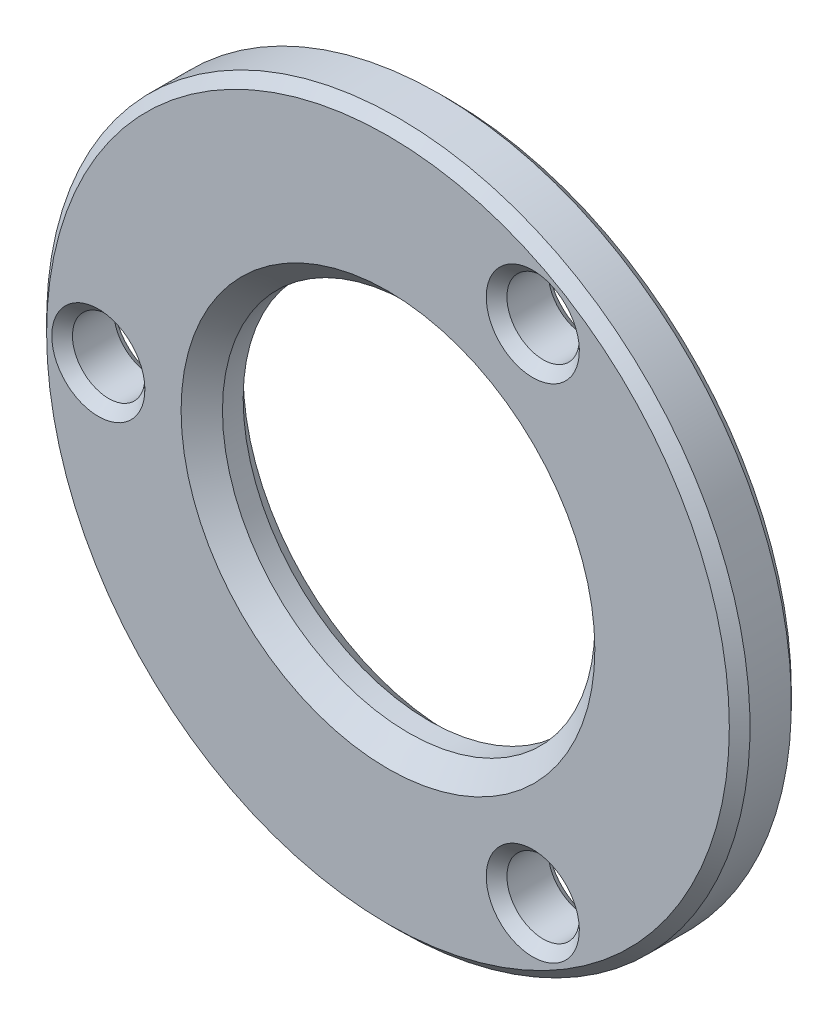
ISO-10303-21;
HEADER;
FILE_DESCRIPTION(('STEP AP214'),'2;1');
FILE_NAME('part.step','',(''),(''),'','','');
FILE_SCHEMA(('AUTOMOTIVE_DESIGN { 1 0 10303 214 1 1 1 1 }'));
ENDSEC;
DATA;
#1=APPLICATION_CONTEXT('core data for automotive mechanical design processes');
#2=APPLICATION_PROTOCOL_DEFINITION('international standard','automotive_design',2000,#1);
#3=PRODUCT_CONTEXT('',#1,'mechanical');
#4=PRODUCT('Part','Part','',(#3));
#5=PRODUCT_RELATED_PRODUCT_CATEGORY('part','',(#4));
#6=PRODUCT_DEFINITION_FORMATION('','',#4);
#7=PRODUCT_DEFINITION_CONTEXT('part definition',#1,'design');
#8=PRODUCT_DEFINITION('design','',#6,#7);
#9=PRODUCT_DEFINITION_SHAPE('','',#8);
#10=(LENGTH_UNIT() NAMED_UNIT(*) SI_UNIT(.MILLI.,.METRE.));
#11=(NAMED_UNIT(*) PLANE_ANGLE_UNIT() SI_UNIT($,.RADIAN.));
#12=(NAMED_UNIT(*) SI_UNIT($,.STERADIAN.) SOLID_ANGLE_UNIT());
#13=UNCERTAINTY_MEASURE_WITH_UNIT(LENGTH_MEASURE(1.E-05),#10,'distance_accuracy_value','');
#14=(GEOMETRIC_REPRESENTATION_CONTEXT(3) GLOBAL_UNCERTAINTY_ASSIGNED_CONTEXT((#13)) GLOBAL_UNIT_ASSIGNED_CONTEXT((#10,
#11,#12)) REPRESENTATION_CONTEXT('',''));
#15=CARTESIAN_POINT('',(0.,0.,0.));
#16=DIRECTION('',(0.,0.,1.));
#17=DIRECTION('',(1.,0.,0.));
#18=AXIS2_PLACEMENT_3D('',#15,#16,#17);
#19=CARTESIAN_POINT('',(0.,0.,3.));
#20=DIRECTION('',(0.,0.,1.));
#21=DIRECTION('',(0.,-1.,0.));
#22=AXIS2_PLACEMENT_3D('',#19,#20,#21);
#23=PLANE('',#22);
#24=CARTESIAN_POINT('',(0.,0.,3.));
#25=DIRECTION('',(0.,0.,1.));
#26=DIRECTION('',(0.,-1.,0.));
#27=AXIS2_PLACEMENT_3D('',#24,#25,#26);
#28=CIRCLE('',#27,10.);
#29=CARTESIAN_POINT('',(0.,-10.,3.));
#30=VERTEX_POINT('',#29);
#31=EDGE_CURVE('E8',#30,#30,#28,.F.);
#32=ORIENTED_EDGE('',*,*,#31,.T.);
#33=EDGE_LOOP('',(#32));
#34=FACE_BOUND('',#33,.T.);
#35=CARTESIAN_POINT('',(0.,0.,3.));
#36=DIRECTION('',(0.,0.,1.));
#37=DIRECTION('',(0.,-1.,0.));
#38=AXIS2_PLACEMENT_3D('',#35,#36,#37);
#39=CIRCLE('',#38,16.5);
#40=CARTESIAN_POINT('',(0.,-16.5,3.));
#41=VERTEX_POINT('',#40);
#42=EDGE_CURVE('E32',#41,#41,#39,.T.);
#43=ORIENTED_EDGE('',*,*,#42,.T.);
#44=EDGE_LOOP('',(#43));
#45=FACE_BOUND('',#44,.T.);
#46=CARTESIAN_POINT('',(-14.,0.,3.));
#47=DIRECTION('',(0.,0.,1.));
#48=DIRECTION('',(0.,-1.,0.));
#49=AXIS2_PLACEMENT_3D('',#46,#47,#48);
#50=CIRCLE('',#49,2.25);
#51=CARTESIAN_POINT('',(-14.,-2.25,3.));
#52=VERTEX_POINT('',#51);
#53=EDGE_CURVE('E74',#52,#52,#50,.T.);
#54=ORIENTED_EDGE('',*,*,#53,.F.);
#55=EDGE_LOOP('',(#54));
#56=FACE_BOUND('',#55,.T.);
#57=CARTESIAN_POINT('',(7.,12.1243556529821,3.));
#58=DIRECTION('',(0.,0.,1.));
#59=DIRECTION('',(0.,-1.,0.));
#60=AXIS2_PLACEMENT_3D('',#57,#58,#59);
#61=CIRCLE('',#60,2.25);
#62=CARTESIAN_POINT('',(7.,9.8743556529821,3.));
#63=VERTEX_POINT('',#62);
#64=EDGE_CURVE('E62',#63,#63,#61,.T.);
#65=ORIENTED_EDGE('',*,*,#64,.F.);
#66=EDGE_LOOP('',(#65));
#67=FACE_BOUND('',#66,.T.);
#68=CARTESIAN_POINT('',(6.99999999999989,-12.1243556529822,3.));
#69=DIRECTION('',(0.,0.,1.));
#70=DIRECTION('',(0.,-1.,0.));
#71=AXIS2_PLACEMENT_3D('',#68,#69,#70);
#72=CIRCLE('',#71,2.25);
#73=CARTESIAN_POINT('',(6.99999999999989,-14.3743556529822,3.));
#74=VERTEX_POINT('',#73);
#75=EDGE_CURVE('E50',#74,#74,#72,.T.);
#76=ORIENTED_EDGE('',*,*,#75,.F.);
#77=EDGE_LOOP('',(#76));
#78=FACE_BOUND('',#77,.T.);
#79=ADVANCED_FACE('F12',(#34,#45,#56,#67,#78),#23,.T.);
#80=CARTESIAN_POINT('',(0.,0.,0.));
#81=DIRECTION('',(0.,0.,1.));
#82=DIRECTION('',(0.,-1.,0.));
#83=AXIS2_PLACEMENT_3D('',#80,#81,#82);
#84=PLANE('',#83);
#85=CARTESIAN_POINT('',(0.,0.,0.));
#86=DIRECTION('',(0.,0.,1.));
#87=DIRECTION('',(0.,-1.,0.));
#88=AXIS2_PLACEMENT_3D('',#85,#86,#87);
#89=CIRCLE('',#88,10.);
#90=CARTESIAN_POINT('',(0.,-10.,0.));
#91=VERTEX_POINT('',#90);
#92=EDGE_CURVE('E27',#91,#91,#89,.T.);
#93=ORIENTED_EDGE('',*,*,#92,.T.);
#94=EDGE_LOOP('',(#93));
#95=FACE_BOUND('',#94,.T.);
#96=CARTESIAN_POINT('',(0.,0.,0.));
#97=DIRECTION('',(0.,0.,1.));
#98=DIRECTION('',(0.,-1.,0.));
#99=AXIS2_PLACEMENT_3D('',#96,#97,#98);
#100=CIRCLE('',#99,16.5);
#101=CARTESIAN_POINT('',(0.,-16.5,0.));
#102=VERTEX_POINT('',#101);
#103=EDGE_CURVE('E35',#102,#102,#100,.F.);
#104=ORIENTED_EDGE('',*,*,#103,.T.);
#105=EDGE_LOOP('',(#104));
#106=FACE_BOUND('',#105,.T.);
#107=CARTESIAN_POINT('',(-14.,0.,0.));
#108=DIRECTION('',(0.,0.,1.));
#109=DIRECTION('',(0.,-1.,0.));
#110=AXIS2_PLACEMENT_3D('',#107,#108,#109);
#111=CIRCLE('',#110,2.25);
#112=CARTESIAN_POINT('',(-14.,-2.25,0.));
#113=VERTEX_POINT('',#112);
#114=EDGE_CURVE('E77',#113,#113,#111,.T.);
#115=ORIENTED_EDGE('',*,*,#114,.T.);
#116=EDGE_LOOP('',(#115));
#117=FACE_BOUND('',#116,.T.);
#118=CARTESIAN_POINT('',(7.,12.1243556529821,0.));
#119=DIRECTION('',(0.,0.,1.));
#120=DIRECTION('',(0.,-1.,0.));
#121=AXIS2_PLACEMENT_3D('',#118,#119,#120);
#122=CIRCLE('',#121,2.25);
#123=CARTESIAN_POINT('',(7.,9.8743556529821,0.));
#124=VERTEX_POINT('',#123);
#125=EDGE_CURVE('E65',#124,#124,#122,.T.);
#126=ORIENTED_EDGE('',*,*,#125,.T.);
#127=EDGE_LOOP('',(#126));
#128=FACE_BOUND('',#127,.T.);
#129=CARTESIAN_POINT('',(6.99999999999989,-12.1243556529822,0.));
#130=DIRECTION('',(0.,0.,1.));
#131=DIRECTION('',(0.,-1.,0.));
#132=AXIS2_PLACEMENT_3D('',#129,#130,#131);
#133=CIRCLE('',#132,2.25);
#134=CARTESIAN_POINT('',(6.99999999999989,-14.3743556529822,0.));
#135=VERTEX_POINT('',#134);
#136=EDGE_CURVE('E53',#135,#135,#133,.T.);
#137=ORIENTED_EDGE('',*,*,#136,.T.);
#138=EDGE_LOOP('',(#137));
#139=FACE_BOUND('',#138,.T.);
#140=ADVANCED_FACE('F81',(#95,#106,#117,#128,#139),#84,.F.);
#141=CARTESIAN_POINT('',(0.,0.,3.));
#142=DIRECTION('',(0.,0.,-1.));
#143=DIRECTION('',(0.,1.,0.));
#144=AXIS2_PLACEMENT_3D('',#141,#142,#143);
#145=CYLINDRICAL_SURFACE('',#144,17.);
#146=CARTESIAN_POINT('',(0.,0.,0.5));
#147=DIRECTION('',(0.,0.,1.));
#148=DIRECTION('',(0.,-1.,0.));
#149=AXIS2_PLACEMENT_3D('',#146,#147,#148);
#150=CIRCLE('',#149,17.);
#151=CARTESIAN_POINT('',(0.,-17.,0.5));
#152=VERTEX_POINT('',#151);
#153=EDGE_CURVE('E38',#152,#152,#150,.T.);
#154=ORIENTED_EDGE('',*,*,#153,.T.);
#155=EDGE_LOOP('',(#154));
#156=FACE_BOUND('',#155,.T.);
#157=CARTESIAN_POINT('',(0.,0.,2.5));
#158=DIRECTION('',(0.,0.,1.));
#159=DIRECTION('',(0.,-1.,0.));
#160=AXIS2_PLACEMENT_3D('',#157,#158,#159);
#161=CIRCLE('',#160,17.);
#162=CARTESIAN_POINT('',(0.,-17.,2.5));
#163=VERTEX_POINT('',#162);
#164=EDGE_CURVE('E41',#163,#163,#161,.F.);
#165=ORIENTED_EDGE('',*,*,#164,.T.);
#166=EDGE_LOOP('',(#165));
#167=FACE_BOUND('',#166,.T.);
#168=ADVANCED_FACE('F136',(#156,#167),#145,.T.);
#169=CARTESIAN_POINT('',(0.,0.,3.));
#170=DIRECTION('',(0.,0.,-1.));
#171=DIRECTION('',(0.,1.,0.));
#172=AXIS2_PLACEMENT_3D('',#169,#170,#171);
#173=CYLINDRICAL_SURFACE('',#172,9.);
#174=CARTESIAN_POINT('',(0.,0.,1.));
#175=DIRECTION('',(0.,0.,1.));
#176=DIRECTION('',(0.,-1.,0.));
#177=AXIS2_PLACEMENT_3D('',#174,#175,#176);
#178=CIRCLE('',#177,9.);
#179=CARTESIAN_POINT('',(0.,-9.,1.));
#180=VERTEX_POINT('',#179);
#181=EDGE_CURVE('E19',#180,#180,#178,.F.);
#182=ORIENTED_EDGE('',*,*,#181,.T.);
#183=EDGE_LOOP('',(#182));
#184=FACE_BOUND('',#183,.T.);
#185=CARTESIAN_POINT('',(0.,0.,2.));
#186=DIRECTION('',(0.,0.,1.));
#187=DIRECTION('',(0.,-1.,0.));
#188=AXIS2_PLACEMENT_3D('',#185,#186,#187);
#189=CIRCLE('',#188,9.);
#190=CARTESIAN_POINT('',(0.,-9.,2.));
#191=VERTEX_POINT('',#190);
#192=EDGE_CURVE('E23',#191,#191,#189,.T.);
#193=ORIENTED_EDGE('',*,*,#192,.T.);
#194=EDGE_LOOP('',(#193));
#195=FACE_BOUND('',#194,.T.);
#196=ADVANCED_FACE('F133',(#184,#195),#173,.F.);
#197=CARTESIAN_POINT('',(6.99999999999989,-12.1243556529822,0.5));
#198=DIRECTION('',(0.,0.,-1.));
#199=DIRECTION('',(0.,1.,0.));
#200=AXIS2_PLACEMENT_3D('',#197,#198,#199);
#201=CONICAL_SURFACE('',#200,1.75,0.785398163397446);
#202=ORIENTED_EDGE('',*,*,#136,.F.);
#203=EDGE_LOOP('',(#202));
#204=FACE_BOUND('',#203,.T.);
#205=CARTESIAN_POINT('',(6.99999999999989,-12.1243556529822,0.5));
#206=DIRECTION('',(0.,0.,1.));
#207=DIRECTION('',(0.,-1.,0.));
#208=AXIS2_PLACEMENT_3D('',#205,#206,#207);
#209=CIRCLE('',#208,1.75);
#210=CARTESIAN_POINT('',(6.99999999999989,-13.8743556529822,0.5));
#211=VERTEX_POINT('',#210);
#212=EDGE_CURVE('E44',#211,#211,#209,.T.);
#213=ORIENTED_EDGE('',*,*,#212,.T.);
#214=EDGE_LOOP('',(#213));
#215=FACE_BOUND('',#214,.T.);
#216=ADVANCED_FACE('F125',(#204,#215),#201,.F.);
#217=CARTESIAN_POINT('',(6.99999999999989,-12.1243556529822,3.));
#218=DIRECTION('',(0.,0.,1.));
#219=DIRECTION('',(0.,-1.,0.));
#220=AXIS2_PLACEMENT_3D('',#217,#218,#219);
#221=CYLINDRICAL_SURFACE('',#220,1.75);
#222=ORIENTED_EDGE('',*,*,#212,.F.);
#223=EDGE_LOOP('',(#222));
#224=FACE_BOUND('',#223,.T.);
#225=CARTESIAN_POINT('',(6.99999999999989,-12.1243556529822,2.5));
#226=DIRECTION('',(0.,0.,1.));
#227=DIRECTION('',(0.,-1.,0.));
#228=AXIS2_PLACEMENT_3D('',#225,#226,#227);
#229=CIRCLE('',#228,1.75);
#230=CARTESIAN_POINT('',(6.99999999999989,-13.8743556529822,2.5));
#231=VERTEX_POINT('',#230);
#232=EDGE_CURVE('E47',#231,#231,#229,.T.);
#233=ORIENTED_EDGE('',*,*,#232,.T.);
#234=EDGE_LOOP('',(#233));
#235=FACE_BOUND('',#234,.T.);
#236=ADVANCED_FACE('F114',(#224,#235),#221,.F.);
#237=CARTESIAN_POINT('',(6.99999999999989,-12.1243556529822,3.));
#238=DIRECTION('',(0.,0.,1.));
#239=DIRECTION('',(0.,-1.,0.));
#240=AXIS2_PLACEMENT_3D('',#237,#238,#239);
#241=CONICAL_SURFACE('',#240,2.25,0.785398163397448);
#242=ORIENTED_EDGE('',*,*,#232,.F.);
#243=EDGE_LOOP('',(#242));
#244=FACE_BOUND('',#243,.T.);
#245=ORIENTED_EDGE('',*,*,#75,.T.);
#246=EDGE_LOOP('',(#245));
#247=FACE_BOUND('',#246,.T.);
#248=ADVANCED_FACE('F111',(#244,#247),#241,.F.);
#249=CARTESIAN_POINT('',(7.,12.1243556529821,0.5));
#250=DIRECTION('',(0.,0.,-1.));
#251=DIRECTION('',(0.,1.,0.));
#252=AXIS2_PLACEMENT_3D('',#249,#250,#251);
#253=CONICAL_SURFACE('',#252,1.75,0.785398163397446);
#254=ORIENTED_EDGE('',*,*,#125,.F.);
#255=EDGE_LOOP('',(#254));
#256=FACE_BOUND('',#255,.T.);
#257=CARTESIAN_POINT('',(7.,12.1243556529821,0.5));
#258=DIRECTION('',(0.,0.,1.));
#259=DIRECTION('',(0.,-1.,0.));
#260=AXIS2_PLACEMENT_3D('',#257,#258,#259);
#261=CIRCLE('',#260,1.75);
#262=CARTESIAN_POINT('',(7.,10.3743556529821,0.5));
#263=VERTEX_POINT('',#262);
#264=EDGE_CURVE('E56',#263,#263,#261,.T.);
#265=ORIENTED_EDGE('',*,*,#264,.T.);
#266=EDGE_LOOP('',(#265));
#267=FACE_BOUND('',#266,.T.);
#268=ADVANCED_FACE('F113',(#256,#267),#253,.F.);
#269=CARTESIAN_POINT('',(7.,12.1243556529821,3.));
#270=DIRECTION('',(0.,0.,1.));
#271=DIRECTION('',(0.,-1.,0.));
#272=AXIS2_PLACEMENT_3D('',#269,#270,#271);
#273=CYLINDRICAL_SURFACE('',#272,1.75);
#274=ORIENTED_EDGE('',*,*,#264,.F.);
#275=EDGE_LOOP('',(#274));
#276=FACE_BOUND('',#275,.T.);
#277=CARTESIAN_POINT('',(7.,12.1243556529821,2.5));
#278=DIRECTION('',(0.,0.,1.));
#279=DIRECTION('',(0.,-1.,0.));
#280=AXIS2_PLACEMENT_3D('',#277,#278,#279);
#281=CIRCLE('',#280,1.75);
#282=CARTESIAN_POINT('',(7.,10.3743556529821,2.5));
#283=VERTEX_POINT('',#282);
#284=EDGE_CURVE('E59',#283,#283,#281,.T.);
#285=ORIENTED_EDGE('',*,*,#284,.T.);
#286=EDGE_LOOP('',(#285));
#287=FACE_BOUND('',#286,.T.);
#288=ADVANCED_FACE('F122',(#276,#287),#273,.F.);
#289=CARTESIAN_POINT('',(7.,12.1243556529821,3.));
#290=DIRECTION('',(0.,0.,1.));
#291=DIRECTION('',(0.,-1.,0.));
#292=AXIS2_PLACEMENT_3D('',#289,#290,#291);
#293=CONICAL_SURFACE('',#292,2.25,0.785398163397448);
#294=ORIENTED_EDGE('',*,*,#284,.F.);
#295=EDGE_LOOP('',(#294));
#296=FACE_BOUND('',#295,.T.);
#297=ORIENTED_EDGE('',*,*,#64,.T.);
#298=EDGE_LOOP('',(#297));
#299=FACE_BOUND('',#298,.T.);
#300=ADVANCED_FACE('F88',(#296,#299),#293,.F.);
#301=CARTESIAN_POINT('',(-14.,0.,0.5));
#302=DIRECTION('',(0.,0.,-1.));
#303=DIRECTION('',(0.,1.,0.));
#304=AXIS2_PLACEMENT_3D('',#301,#302,#303);
#305=CONICAL_SURFACE('',#304,1.75,0.785398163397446);
#306=ORIENTED_EDGE('',*,*,#114,.F.);
#307=EDGE_LOOP('',(#306));
#308=FACE_BOUND('',#307,.T.);
#309=CARTESIAN_POINT('',(-14.,0.,0.5));
#310=DIRECTION('',(0.,0.,1.));
#311=DIRECTION('',(0.,-1.,0.));
#312=AXIS2_PLACEMENT_3D('',#309,#310,#311);
#313=CIRCLE('',#312,1.75);
#314=CARTESIAN_POINT('',(-14.,-1.75,0.5));
#315=VERTEX_POINT('',#314);
#316=EDGE_CURVE('E68',#315,#315,#313,.T.);
#317=ORIENTED_EDGE('',*,*,#316,.T.);
#318=EDGE_LOOP('',(#317));
#319=FACE_BOUND('',#318,.T.);
#320=ADVANCED_FACE('F84',(#308,#319),#305,.F.);
#321=CARTESIAN_POINT('',(-14.,0.,3.));
#322=DIRECTION('',(0.,0.,1.));
#323=DIRECTION('',(0.,-1.,0.));
#324=AXIS2_PLACEMENT_3D('',#321,#322,#323);
#325=CYLINDRICAL_SURFACE('',#324,1.75);
#326=ORIENTED_EDGE('',*,*,#316,.F.);
#327=EDGE_LOOP('',(#326));
#328=FACE_BOUND('',#327,.T.);
#329=CARTESIAN_POINT('',(-14.,0.,2.5));
#330=DIRECTION('',(0.,0.,1.));
#331=DIRECTION('',(0.,-1.,0.));
#332=AXIS2_PLACEMENT_3D('',#329,#330,#331);
#333=CIRCLE('',#332,1.75);
#334=CARTESIAN_POINT('',(-14.,-1.75,2.5));
#335=VERTEX_POINT('',#334);
#336=EDGE_CURVE('E71',#335,#335,#333,.T.);
#337=ORIENTED_EDGE('',*,*,#336,.T.);
#338=EDGE_LOOP('',(#337));
#339=FACE_BOUND('',#338,.T.);
#340=ADVANCED_FACE('F87',(#328,#339),#325,.F.);
#341=CARTESIAN_POINT('',(-14.,0.,3.));
#342=DIRECTION('',(0.,0.,1.));
#343=DIRECTION('',(0.,-1.,0.));
#344=AXIS2_PLACEMENT_3D('',#341,#342,#343);
#345=CONICAL_SURFACE('',#344,2.25,0.785398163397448);
#346=ORIENTED_EDGE('',*,*,#336,.F.);
#347=EDGE_LOOP('',(#346));
#348=FACE_BOUND('',#347,.T.);
#349=ORIENTED_EDGE('',*,*,#53,.T.);
#350=EDGE_LOOP('',(#349));
#351=FACE_BOUND('',#350,.T.);
#352=ADVANCED_FACE('F94',(#348,#351),#345,.F.);
#353=CARTESIAN_POINT('',(0.,0.,0.5));
#354=DIRECTION('',(0.,0.,1.));
#355=DIRECTION('',(0.,-1.,0.));
#356=AXIS2_PLACEMENT_3D('',#353,#354,#355);
#357=CONICAL_SURFACE('',#356,17.,0.785398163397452);
#358=ORIENTED_EDGE('',*,*,#103,.F.);
#359=EDGE_LOOP('',(#358));
#360=FACE_BOUND('',#359,.T.);
#361=ORIENTED_EDGE('',*,*,#153,.F.);
#362=EDGE_LOOP('',(#361));
#363=FACE_BOUND('',#362,.T.);
#364=ADVANCED_FACE('F100',(#360,#363),#357,.T.);
#365=CARTESIAN_POINT('',(0.,0.,3.));
#366=DIRECTION('',(0.,0.,-1.));
#367=DIRECTION('',(0.,1.,0.));
#368=AXIS2_PLACEMENT_3D('',#365,#366,#367);
#369=CONICAL_SURFACE('',#368,16.5,0.785398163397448);
#370=ORIENTED_EDGE('',*,*,#164,.F.);
#371=EDGE_LOOP('',(#370));
#372=FACE_BOUND('',#371,.T.);
#373=ORIENTED_EDGE('',*,*,#42,.F.);
#374=EDGE_LOOP('',(#373));
#375=FACE_BOUND('',#374,.T.);
#376=ADVANCED_FACE('F146',(#372,#375),#369,.T.);
#377=CARTESIAN_POINT('',(0.,0.,0.));
#378=DIRECTION('',(0.,0.,-1.));
#379=DIRECTION('',(0.,1.,0.));
#380=AXIS2_PLACEMENT_3D('',#377,#378,#379);
#381=CONICAL_SURFACE('',#380,10.,0.785398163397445);
#382=ORIENTED_EDGE('',*,*,#181,.F.);
#383=EDGE_LOOP('',(#382));
#384=FACE_BOUND('',#383,.T.);
#385=ORIENTED_EDGE('',*,*,#92,.F.);
#386=EDGE_LOOP('',(#385));
#387=FACE_BOUND('',#386,.T.);
#388=ADVANCED_FACE('F149',(#384,#387),#381,.F.);
#389=CARTESIAN_POINT('',(0.,0.,2.));
#390=DIRECTION('',(0.,0.,1.));
#391=DIRECTION('',(0.,-1.,0.));
#392=AXIS2_PLACEMENT_3D('',#389,#390,#391);
#393=CONICAL_SURFACE('',#392,9.,0.78539816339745);
#394=ORIENTED_EDGE('',*,*,#31,.F.);
#395=EDGE_LOOP('',(#394));
#396=FACE_BOUND('',#395,.T.);
#397=ORIENTED_EDGE('',*,*,#192,.F.);
#398=EDGE_LOOP('',(#397));
#399=FACE_BOUND('',#398,.T.);
#400=ADVANCED_FACE('F14',(#396,#399),#393,.F.);
#401=CLOSED_SHELL('',(#79,#140,#168,#196,#216,#236,#248,#268,#288,#300,#320,#340,#352,#364,#376,
#388,#400));
#402=MANIFOLD_SOLID_BREP('B1',#401);
#403=ADVANCED_BREP_SHAPE_REPRESENTATION('',(#18,#402),#14);
#404=SHAPE_DEFINITION_REPRESENTATION(#9,#403);
ENDSEC;
END-ISO-10303-21;
